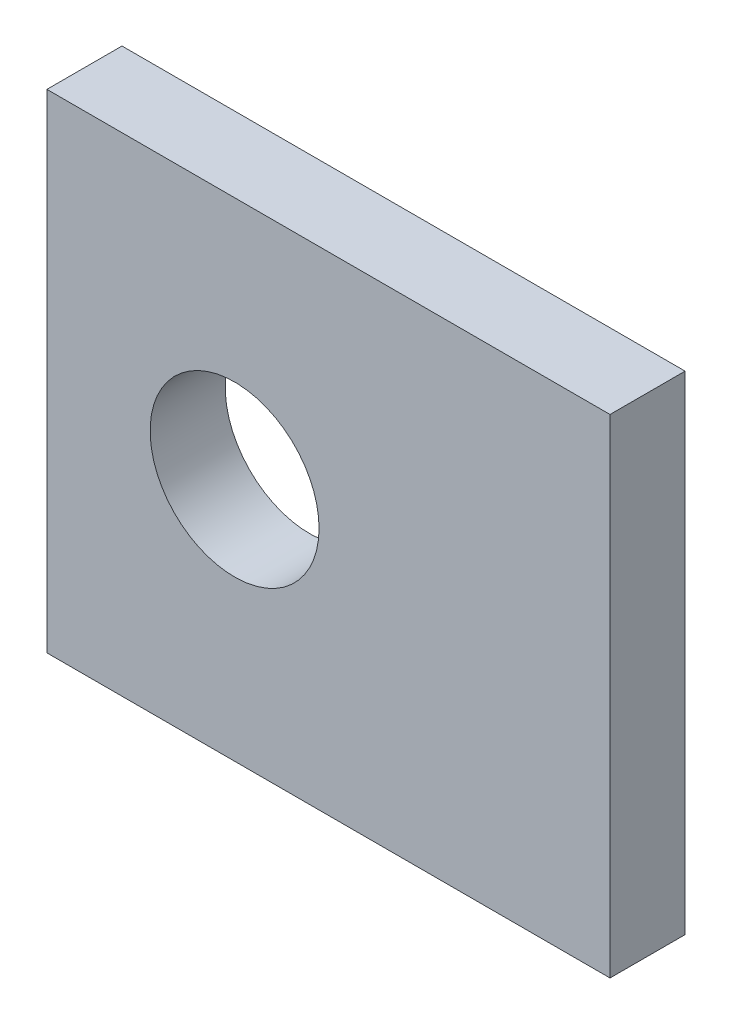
ISO-10303-21;
HEADER;
FILE_DESCRIPTION(('STEP AP214'),'2;1');
FILE_NAME('part.step','',(''),(''),'','','');
FILE_SCHEMA(('AUTOMOTIVE_DESIGN { 1 0 10303 214 1 1 1 1 }'));
ENDSEC;
DATA;
#1=APPLICATION_CONTEXT('core data for automotive mechanical design processes');
#2=APPLICATION_PROTOCOL_DEFINITION('international standard','automotive_design',2000,#1);
#3=PRODUCT_CONTEXT('',#1,'mechanical');
#4=PRODUCT('Part','Part','',(#3));
#5=PRODUCT_RELATED_PRODUCT_CATEGORY('part','',(#4));
#6=PRODUCT_DEFINITION_FORMATION('','',#4);
#7=PRODUCT_DEFINITION_CONTEXT('part definition',#1,'design');
#8=PRODUCT_DEFINITION('design','',#6,#7);
#9=PRODUCT_DEFINITION_SHAPE('','',#8);
#10=(LENGTH_UNIT() NAMED_UNIT(*) SI_UNIT(.MILLI.,.METRE.));
#11=(NAMED_UNIT(*) PLANE_ANGLE_UNIT() SI_UNIT($,.RADIAN.));
#12=(NAMED_UNIT(*) SI_UNIT($,.STERADIAN.) SOLID_ANGLE_UNIT());
#13=UNCERTAINTY_MEASURE_WITH_UNIT(LENGTH_MEASURE(1.E-05),#10,'distance_accuracy_value','');
#14=(GEOMETRIC_REPRESENTATION_CONTEXT(3) GLOBAL_UNCERTAINTY_ASSIGNED_CONTEXT((#13)) GLOBAL_UNIT_ASSIGNED_CONTEXT((#10,
#11,#12)) REPRESENTATION_CONTEXT('',''));
#15=CARTESIAN_POINT('',(0.,0.,0.));
#16=DIRECTION('',(0.,0.,1.));
#17=DIRECTION('',(1.,0.,0.));
#18=AXIS2_PLACEMENT_3D('',#15,#16,#17);
#19=CARTESIAN_POINT('',(15.,-13.,2.));
#20=DIRECTION('',(0.,0.,1.));
#21=DIRECTION('',(1.,0.,0.));
#22=AXIS2_PLACEMENT_3D('',#19,#20,#21);
#23=PLANE('',#22);
#24=DIRECTION('',(1.,0.,0.));
#25=VECTOR('',#24,1.);
#26=CARTESIAN_POINT('',(0.,-13.,2.));
#27=LINE('',#26,#25);
#28=CARTESIAN_POINT('',(0.,-13.,2.));
#29=VERTEX_POINT('',#28);
#30=CARTESIAN_POINT('',(15.,-13.,2.));
#31=VERTEX_POINT('',#30);
#32=EDGE_CURVE('E84',#29,#31,#27,.T.);
#33=ORIENTED_EDGE('',*,*,#32,.T.);
#34=DIRECTION('',(0.,1.,0.));
#35=VECTOR('',#34,1.);
#36=CARTESIAN_POINT('',(15.,-13.,2.));
#37=LINE('',#36,#35);
#38=CARTESIAN_POINT('',(15.,0.,2.));
#39=VERTEX_POINT('',#38);
#40=EDGE_CURVE('E79',#31,#39,#37,.T.);
#41=ORIENTED_EDGE('',*,*,#40,.T.);
#42=DIRECTION('',(-1.,0.,0.));
#43=VECTOR('',#42,1.);
#44=CARTESIAN_POINT('',(0.,0.,2.));
#45=LINE('',#44,#43);
#46=CARTESIAN_POINT('',(0.,0.,2.));
#47=VERTEX_POINT('',#46);
#48=EDGE_CURVE('E82',#39,#47,#45,.T.);
#49=ORIENTED_EDGE('',*,*,#48,.T.);
#50=DIRECTION('',(0.,-1.,0.));
#51=VECTOR('',#50,1.);
#52=CARTESIAN_POINT('',(0.,-13.,2.));
#53=LINE('',#52,#51);
#54=EDGE_CURVE('E49',#47,#29,#53,.T.);
#55=ORIENTED_EDGE('',*,*,#54,.T.);
#56=EDGE_LOOP('',(#33,#41,#49,#55));
#57=FACE_BOUND('',#56,.T.);
#58=CARTESIAN_POINT('',(5.,-6.5,2.));
#59=DIRECTION('',(0.,0.,1.));
#60=DIRECTION('',(1.,0.,0.));
#61=AXIS2_PLACEMENT_3D('',#58,#59,#60);
#62=CIRCLE('',#61,2.25);
#63=CARTESIAN_POINT('',(7.25,-6.5,2.));
#64=VERTEX_POINT('',#63);
#65=EDGE_CURVE('E99',#64,#64,#62,.T.);
#66=ORIENTED_EDGE('',*,*,#65,.F.);
#67=EDGE_LOOP('',(#66));
#68=FACE_BOUND('',#67,.T.);
#69=ADVANCED_FACE('F32',(#57,#68),#23,.T.);
#70=CARTESIAN_POINT('',(15.,-13.,0.));
#71=DIRECTION('',(0.,0.,1.));
#72=DIRECTION('',(1.,0.,0.));
#73=AXIS2_PLACEMENT_3D('',#70,#71,#72);
#74=PLANE('',#73);
#75=DIRECTION('',(1.,0.,0.));
#76=VECTOR('',#75,1.);
#77=CARTESIAN_POINT('',(0.,-13.,0.));
#78=LINE('',#77,#76);
#79=CARTESIAN_POINT('',(0.,-13.,0.));
#80=VERTEX_POINT('',#79);
#81=CARTESIAN_POINT('',(15.,-13.,0.));
#82=VERTEX_POINT('',#81);
#83=EDGE_CURVE('E96',#80,#82,#78,.T.);
#84=ORIENTED_EDGE('',*,*,#83,.F.);
#85=DIRECTION('',(0.,-1.,0.));
#86=VECTOR('',#85,1.);
#87=CARTESIAN_POINT('',(0.,-13.,0.));
#88=LINE('',#87,#86);
#89=CARTESIAN_POINT('',(0.,0.,0.));
#90=VERTEX_POINT('',#89);
#91=EDGE_CURVE('E72',#90,#80,#88,.T.);
#92=ORIENTED_EDGE('',*,*,#91,.F.);
#93=DIRECTION('',(-1.,0.,0.));
#94=VECTOR('',#93,1.);
#95=CARTESIAN_POINT('',(0.,0.,0.));
#96=LINE('',#95,#94);
#97=CARTESIAN_POINT('',(15.,0.,0.));
#98=VERTEX_POINT('',#97);
#99=EDGE_CURVE('E66',#98,#90,#96,.T.);
#100=ORIENTED_EDGE('',*,*,#99,.F.);
#101=DIRECTION('',(0.,1.,0.));
#102=VECTOR('',#101,1.);
#103=CARTESIAN_POINT('',(15.,-13.,0.));
#104=LINE('',#103,#102);
#105=EDGE_CURVE('E88',#82,#98,#104,.T.);
#106=ORIENTED_EDGE('',*,*,#105,.F.);
#107=EDGE_LOOP('',(#84,#92,#100,#106));
#108=FACE_BOUND('',#107,.T.);
#109=CARTESIAN_POINT('',(5.,-6.5,0.));
#110=DIRECTION('',(0.,0.,1.));
#111=DIRECTION('',(1.,0.,0.));
#112=AXIS2_PLACEMENT_3D('',#109,#110,#111);
#113=CIRCLE('',#112,2.25);
#114=CARTESIAN_POINT('',(7.25,-6.5,0.));
#115=VERTEX_POINT('',#114);
#116=EDGE_CURVE('E111',#115,#115,#113,.T.);
#117=ORIENTED_EDGE('',*,*,#116,.T.);
#118=EDGE_LOOP('',(#117));
#119=FACE_BOUND('',#118,.T.);
#120=ADVANCED_FACE('F107',(#108,#119),#74,.F.);
#121=CARTESIAN_POINT('',(0.,-13.,2.));
#122=DIRECTION('',(0.,1.,0.));
#123=DIRECTION('',(0.,0.,1.));
#124=AXIS2_PLACEMENT_3D('',#121,#122,#123);
#125=PLANE('',#124);
#126=ORIENTED_EDGE('',*,*,#83,.T.);
#127=DIRECTION('',(0.,0.,-1.));
#128=VECTOR('',#127,1.);
#129=CARTESIAN_POINT('',(15.,-13.,2.));
#130=LINE('',#129,#128);
#131=EDGE_CURVE('E11',#31,#82,#130,.T.);
#132=ORIENTED_EDGE('',*,*,#131,.F.);
#133=ORIENTED_EDGE('',*,*,#32,.F.);
#134=DIRECTION('',(0.,0.,-1.));
#135=VECTOR('',#134,1.);
#136=CARTESIAN_POINT('',(0.,-13.,2.));
#137=LINE('',#136,#135);
#138=EDGE_CURVE('E92',#29,#80,#137,.T.);
#139=ORIENTED_EDGE('',*,*,#138,.T.);
#140=EDGE_LOOP('',(#126,#132,#133,#139));
#141=FACE_BOUND('',#140,.T.);
#142=ADVANCED_FACE('F34',(#141),#125,.F.);
#143=CARTESIAN_POINT('',(15.,-13.,2.));
#144=DIRECTION('',(-1.,0.,0.));
#145=DIRECTION('',(0.,0.,1.));
#146=AXIS2_PLACEMENT_3D('',#143,#144,#145);
#147=PLANE('',#146);
#148=ORIENTED_EDGE('',*,*,#105,.T.);
#149=DIRECTION('',(0.,0.,-1.));
#150=VECTOR('',#149,1.);
#151=CARTESIAN_POINT('',(15.,0.,2.));
#152=LINE('',#151,#150);
#153=EDGE_CURVE('E41',#39,#98,#152,.T.);
#154=ORIENTED_EDGE('',*,*,#153,.F.);
#155=ORIENTED_EDGE('',*,*,#40,.F.);
#156=ORIENTED_EDGE('',*,*,#131,.T.);
#157=EDGE_LOOP('',(#148,#154,#155,#156));
#158=FACE_BOUND('',#157,.T.);
#159=ADVANCED_FACE('F87',(#158),#147,.F.);
#160=CARTESIAN_POINT('',(0.,0.,2.));
#161=DIRECTION('',(0.,-1.,0.));
#162=DIRECTION('',(0.,0.,-1.));
#163=AXIS2_PLACEMENT_3D('',#160,#161,#162);
#164=PLANE('',#163);
#165=ORIENTED_EDGE('',*,*,#99,.T.);
#166=DIRECTION('',(0.,0.,-1.));
#167=VECTOR('',#166,1.);
#168=CARTESIAN_POINT('',(0.,0.,2.));
#169=LINE('',#168,#167);
#170=EDGE_CURVE('E89',#47,#90,#169,.T.);
#171=ORIENTED_EDGE('',*,*,#170,.F.);
#172=ORIENTED_EDGE('',*,*,#48,.F.);
#173=ORIENTED_EDGE('',*,*,#153,.T.);
#174=EDGE_LOOP('',(#165,#171,#172,#173));
#175=FACE_BOUND('',#174,.T.);
#176=ADVANCED_FACE('F90',(#175),#164,.F.);
#177=CARTESIAN_POINT('',(0.,-13.,2.));
#178=DIRECTION('',(1.,0.,0.));
#179=DIRECTION('',(0.,0.,-1.));
#180=AXIS2_PLACEMENT_3D('',#177,#178,#179);
#181=PLANE('',#180);
#182=ORIENTED_EDGE('',*,*,#91,.T.);
#183=ORIENTED_EDGE('',*,*,#138,.F.);
#184=ORIENTED_EDGE('',*,*,#54,.F.);
#185=ORIENTED_EDGE('',*,*,#170,.T.);
#186=EDGE_LOOP('',(#182,#183,#184,#185));
#187=FACE_BOUND('',#186,.T.);
#188=ADVANCED_FACE('F104',(#187),#181,.F.);
#189=CARTESIAN_POINT('',(5.,-6.5,2.));
#190=DIRECTION('',(0.,0.,-1.));
#191=DIRECTION('',(-1.,0.,0.));
#192=AXIS2_PLACEMENT_3D('',#189,#190,#191);
#193=CYLINDRICAL_SURFACE('',#192,2.25);
#194=ORIENTED_EDGE('',*,*,#65,.T.);
#195=EDGE_LOOP('',(#194));
#196=FACE_BOUND('',#195,.T.);
#197=ORIENTED_EDGE('',*,*,#116,.F.);
#198=EDGE_LOOP('',(#197));
#199=FACE_BOUND('',#198,.T.);
#200=ADVANCED_FACE('F117',(#196,#199),#193,.F.);
#201=CLOSED_SHELL('',(#69,#120,#142,#159,#176,#188,#200));
#202=MANIFOLD_SOLID_BREP('B2',#201);
#203=ADVANCED_BREP_SHAPE_REPRESENTATION('',(#18,#202),#14);
#204=SHAPE_DEFINITION_REPRESENTATION(#9,#203);
ENDSEC;
END-ISO-10303-21;
